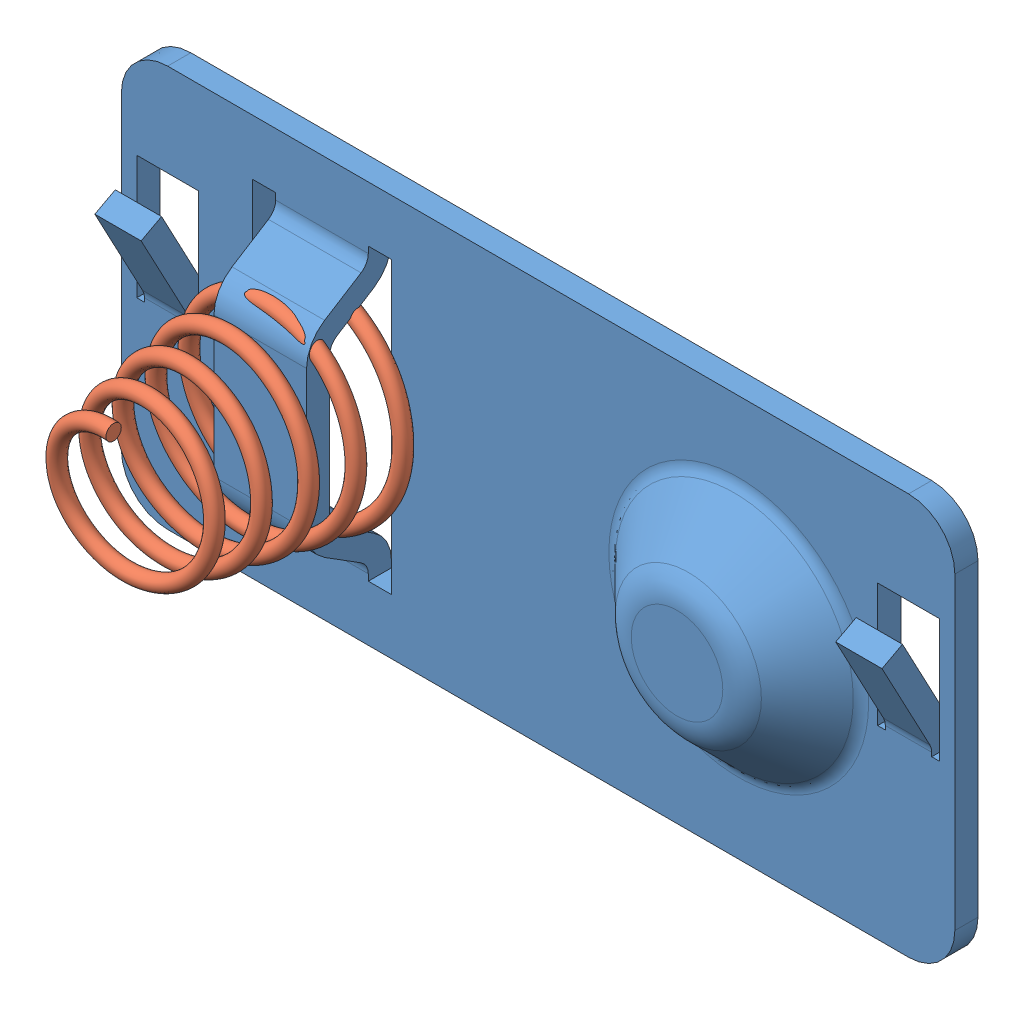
SolidWorks assembly lamelle piles.SLDASM, configuration Default (file format 14000). Lengths in mm.
Overall size (27 13 7.75).
2 component instances, 2 part files, 4 mates.
Components (placement in the parent):
- lamelle pile-1: lamelle pile.SLDPRT [Default] at (6.5553 0.0491 -3.4925) size (27 13 2.75)
- ressort pile-1: ressort pile.SLDPRT [Default] at (-6.9447 0.0491 -2.4925) size (7.09 7.03 7.31)
Mates (geometry in assembly coordinates):
- Perpendiculaire1: perpendicular: plane of lamelle pile-1 through (-5.4447 -2.9095 -0.7425) normal (0 0 1); line of ressort pile-1 through (-6.9447 0.0491 -3.0556) axis (0 0 1)
- Distance1: distance = 6.5 mm: plane of lamelle pile-1 through (-11.9447 6.5491 -2.7425) normal (0 1 0); line of ressort pile-1 through (-6.9447 0.0491 -3.0556) axis (0 0 1)
- Distance2: distance = 6.5 mm: plane of lamelle pile-1 through (-13.4447 -4.9509 -2.7425) normal (-1 0 0); line of ressort pile-1 through (-6.9447 0.0491 -3.0556) axis (0 0 1)
- Distance3: distance = 0.25 mm: plane of lamelle pile-1 through (12.0553 5.0491 -2.7425) normal (0 0 1); point of ressort pile-1
